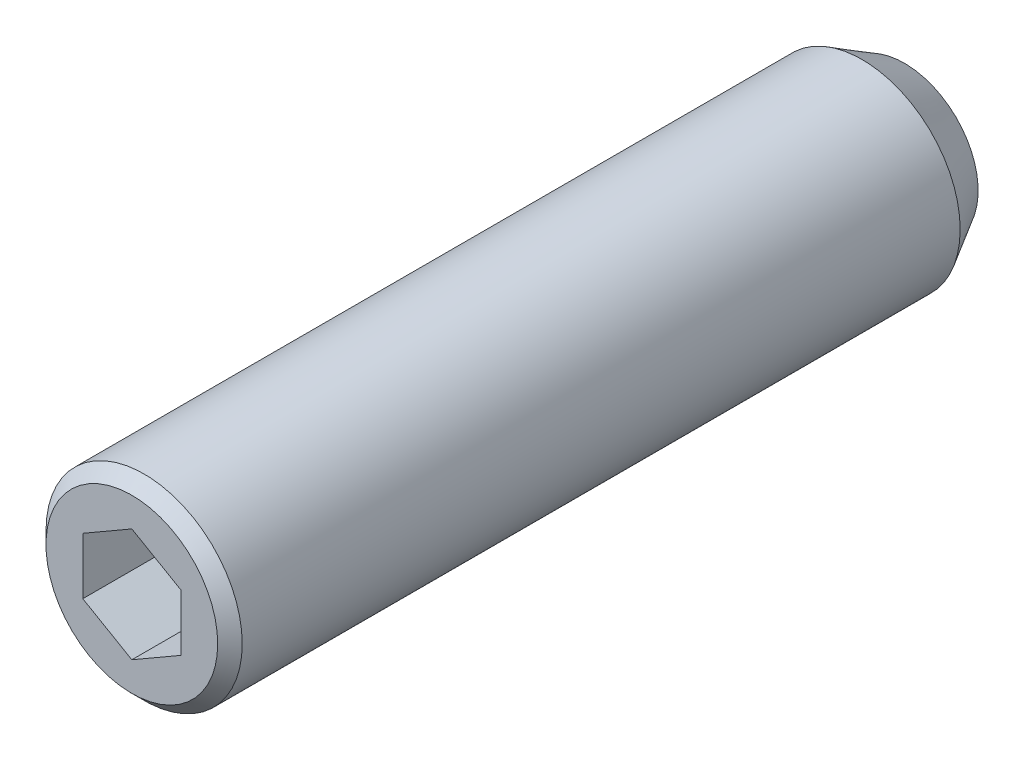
ISO-10303-21;
HEADER;
FILE_DESCRIPTION(('STEP AP214'),'2;1');
FILE_NAME('part.step','',(''),(''),'','','');
FILE_SCHEMA(('AUTOMOTIVE_DESIGN { 1 0 10303 214 1 1 1 1 }'));
ENDSEC;
DATA;
#1=APPLICATION_CONTEXT('core data for automotive mechanical design processes');
#2=APPLICATION_PROTOCOL_DEFINITION('international standard','automotive_design',2000,#1);
#3=PRODUCT_CONTEXT('',#1,'mechanical');
#4=PRODUCT('Part','Part','',(#3));
#5=PRODUCT_RELATED_PRODUCT_CATEGORY('part','',(#4));
#6=PRODUCT_DEFINITION_FORMATION('','',#4);
#7=PRODUCT_DEFINITION_CONTEXT('part definition',#1,'design');
#8=PRODUCT_DEFINITION('design','',#6,#7);
#9=PRODUCT_DEFINITION_SHAPE('','',#8);
#10=(LENGTH_UNIT() NAMED_UNIT(*) SI_UNIT(.MILLI.,.METRE.));
#11=(NAMED_UNIT(*) PLANE_ANGLE_UNIT() SI_UNIT($,.RADIAN.));
#12=(NAMED_UNIT(*) SI_UNIT($,.STERADIAN.) SOLID_ANGLE_UNIT());
#13=UNCERTAINTY_MEASURE_WITH_UNIT(LENGTH_MEASURE(1.E-05),#10,'distance_accuracy_value','');
#14=(GEOMETRIC_REPRESENTATION_CONTEXT(3) GLOBAL_UNCERTAINTY_ASSIGNED_CONTEXT((#13)) GLOBAL_UNIT_ASSIGNED_CONTEXT((#10,
#11,#12)) REPRESENTATION_CONTEXT('',''));
#15=CARTESIAN_POINT('',(0.,0.,0.));
#16=DIRECTION('',(0.,0.,1.));
#17=DIRECTION('',(1.,0.,0.));
#18=AXIS2_PLACEMENT_3D('',#15,#16,#17);
#19=CARTESIAN_POINT('',(1.,0.577350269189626,14.));
#20=DIRECTION('',(0.5,0.866025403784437,0.));
#21=DIRECTION('',(0.866025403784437,-0.5,0.));
#22=AXIS2_PLACEMENT_3D('',#19,#20,#21);
#23=PLANE('',#22);
#24=DIRECTION('',(0.,0.,1.));
#25=VECTOR('',#24,1.);
#26=CARTESIAN_POINT('',(1.,0.577350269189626,14.));
#27=LINE('',#26,#25);
#28=CARTESIAN_POINT('',(1.,0.577350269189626,14.));
#29=VERTEX_POINT('',#28);
#30=CARTESIAN_POINT('',(1.,0.577350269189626,16.));
#31=VERTEX_POINT('',#30);
#32=EDGE_CURVE('E96',#29,#31,#27,.T.);
#33=ORIENTED_EDGE('',*,*,#32,.T.);
#34=DIRECTION('',(-0.866025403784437,0.5,0.));
#35=VECTOR('',#34,1.);
#36=CARTESIAN_POINT('',(1.,0.577350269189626,16.));
#37=LINE('',#36,#35);
#38=CARTESIAN_POINT('',(0.,1.15470053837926,16.));
#39=VERTEX_POINT('',#38);
#40=EDGE_CURVE('E29',#31,#39,#37,.T.);
#41=ORIENTED_EDGE('',*,*,#40,.T.);
#42=DIRECTION('',(0.,0.,1.));
#43=VECTOR('',#42,1.);
#44=CARTESIAN_POINT('',(0.,1.15470053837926,14.));
#45=LINE('',#44,#43);
#46=CARTESIAN_POINT('',(0.,1.15470053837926,14.));
#47=VERTEX_POINT('',#46);
#48=EDGE_CURVE('E34',#47,#39,#45,.T.);
#49=ORIENTED_EDGE('',*,*,#48,.F.);
#50=DIRECTION('',(-0.866025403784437,0.5,0.));
#51=VECTOR('',#50,1.);
#52=CARTESIAN_POINT('',(1.,0.577350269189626,14.));
#53=LINE('',#52,#51);
#54=EDGE_CURVE('E90',#29,#47,#53,.T.);
#55=ORIENTED_EDGE('',*,*,#54,.F.);
#56=EDGE_LOOP('',(#33,#41,#49,#55));
#57=FACE_BOUND('',#56,.T.);
#58=ADVANCED_FACE('F14',(#57),#23,.F.);
#59=CARTESIAN_POINT('',(1.,-0.577350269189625,14.));
#60=DIRECTION('',(1.,0.,0.));
#61=DIRECTION('',(0.,-1.,0.));
#62=AXIS2_PLACEMENT_3D('',#59,#60,#61);
#63=PLANE('',#62);
#64=DIRECTION('',(0.,0.,1.));
#65=VECTOR('',#64,1.);
#66=CARTESIAN_POINT('',(1.,-0.577350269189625,14.));
#67=LINE('',#66,#65);
#68=CARTESIAN_POINT('',(1.,-0.577350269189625,14.));
#69=VERTEX_POINT('',#68);
#70=CARTESIAN_POINT('',(1.,-0.577350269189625,16.));
#71=VERTEX_POINT('',#70);
#72=EDGE_CURVE('E93',#69,#71,#67,.T.);
#73=ORIENTED_EDGE('',*,*,#72,.T.);
#74=DIRECTION('',(0.,1.,0.));
#75=VECTOR('',#74,1.);
#76=CARTESIAN_POINT('',(1.,-0.577350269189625,16.));
#77=LINE('',#76,#75);
#78=EDGE_CURVE('E120',#71,#31,#77,.T.);
#79=ORIENTED_EDGE('',*,*,#78,.T.);
#80=ORIENTED_EDGE('',*,*,#32,.F.);
#81=DIRECTION('',(0.,1.,0.));
#82=VECTOR('',#81,1.);
#83=CARTESIAN_POINT('',(1.,-0.577350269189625,14.));
#84=LINE('',#83,#82);
#85=EDGE_CURVE('E85',#69,#29,#84,.T.);
#86=ORIENTED_EDGE('',*,*,#85,.F.);
#87=EDGE_LOOP('',(#73,#79,#80,#86));
#88=FACE_BOUND('',#87,.T.);
#89=ADVANCED_FACE('F149',(#88),#63,.F.);
#90=CARTESIAN_POINT('',(1.,-0.577350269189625,14.));
#91=DIRECTION('',(-0.5,0.866025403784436,0.));
#92=DIRECTION('',(0.866025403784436,0.5,0.));
#93=AXIS2_PLACEMENT_3D('',#90,#91,#92);
#94=PLANE('',#93);
#95=DIRECTION('',(0.,0.,1.));
#96=VECTOR('',#95,1.);
#97=CARTESIAN_POINT('',(0.,-1.15470053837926,14.));
#98=LINE('',#97,#96);
#99=CARTESIAN_POINT('',(0.,-1.15470053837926,14.));
#100=VERTEX_POINT('',#99);
#101=CARTESIAN_POINT('',(0.,-1.15470053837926,16.));
#102=VERTEX_POINT('',#101);
#103=EDGE_CURVE('E68',#100,#102,#98,.T.);
#104=ORIENTED_EDGE('',*,*,#103,.T.);
#105=DIRECTION('',(-0.866025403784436,-0.5,0.));
#106=VECTOR('',#105,1.);
#107=CARTESIAN_POINT('',(1.,-0.577350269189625,16.));
#108=LINE('',#107,#106);
#109=EDGE_CURVE('E131',#71,#102,#108,.T.);
#110=ORIENTED_EDGE('',*,*,#109,.F.);
#111=ORIENTED_EDGE('',*,*,#72,.F.);
#112=DIRECTION('',(-0.866025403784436,-0.5,0.));
#113=VECTOR('',#112,1.);
#114=CARTESIAN_POINT('',(1.,-0.577350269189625,14.));
#115=LINE('',#114,#113);
#116=EDGE_CURVE('E83',#69,#100,#115,.T.);
#117=ORIENTED_EDGE('',*,*,#116,.T.);
#118=EDGE_LOOP('',(#104,#110,#111,#117));
#119=FACE_BOUND('',#118,.T.);
#120=ADVANCED_FACE('F155',(#119),#94,.T.);
#121=CARTESIAN_POINT('',(-1.,-0.577350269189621,14.));
#122=DIRECTION('',(-0.5,-0.866025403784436,0.));
#123=DIRECTION('',(-0.866025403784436,0.5,0.));
#124=AXIS2_PLACEMENT_3D('',#121,#122,#123);
#125=PLANE('',#124);
#126=DIRECTION('',(0.,0.,1.));
#127=VECTOR('',#126,1.);
#128=CARTESIAN_POINT('',(-1.,-0.577350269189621,14.));
#129=LINE('',#128,#127);
#130=CARTESIAN_POINT('',(-1.,-0.577350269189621,14.));
#131=VERTEX_POINT('',#130);
#132=CARTESIAN_POINT('',(-1.,-0.577350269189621,16.));
#133=VERTEX_POINT('',#132);
#134=EDGE_CURVE('E56',#131,#133,#129,.T.);
#135=ORIENTED_EDGE('',*,*,#134,.T.);
#136=DIRECTION('',(0.866025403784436,-0.5,0.));
#137=VECTOR('',#136,1.);
#138=CARTESIAN_POINT('',(-1.,-0.577350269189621,16.));
#139=LINE('',#138,#137);
#140=EDGE_CURVE('E128',#133,#102,#139,.T.);
#141=ORIENTED_EDGE('',*,*,#140,.T.);
#142=ORIENTED_EDGE('',*,*,#103,.F.);
#143=DIRECTION('',(0.866025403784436,-0.5,0.));
#144=VECTOR('',#143,1.);
#145=CARTESIAN_POINT('',(-1.,-0.577350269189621,14.));
#146=LINE('',#145,#144);
#147=EDGE_CURVE('E76',#131,#100,#146,.T.);
#148=ORIENTED_EDGE('',*,*,#147,.F.);
#149=EDGE_LOOP('',(#135,#141,#142,#148));
#150=FACE_BOUND('',#149,.T.);
#151=ADVANCED_FACE('F81',(#150),#125,.F.);
#152=CARTESIAN_POINT('',(-1.,-0.577350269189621,14.));
#153=DIRECTION('',(1.,0.,0.));
#154=DIRECTION('',(0.,-1.,0.));
#155=AXIS2_PLACEMENT_3D('',#152,#153,#154);
#156=PLANE('',#155);
#157=DIRECTION('',(0.,0.,1.));
#158=VECTOR('',#157,1.);
#159=CARTESIAN_POINT('',(-1.,0.577350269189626,14.));
#160=LINE('',#159,#158);
#161=CARTESIAN_POINT('',(-1.,0.577350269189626,14.));
#162=VERTEX_POINT('',#161);
#163=CARTESIAN_POINT('',(-1.,0.577350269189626,16.));
#164=VERTEX_POINT('',#163);
#165=EDGE_CURVE('E69',#162,#164,#160,.T.);
#166=ORIENTED_EDGE('',*,*,#165,.T.);
#167=DIRECTION('',(0.,1.,0.));
#168=VECTOR('',#167,1.);
#169=CARTESIAN_POINT('',(-1.,-0.577350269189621,16.));
#170=LINE('',#169,#168);
#171=EDGE_CURVE('E63',#133,#164,#170,.T.);
#172=ORIENTED_EDGE('',*,*,#171,.F.);
#173=ORIENTED_EDGE('',*,*,#134,.F.);
#174=DIRECTION('',(0.,1.,0.));
#175=VECTOR('',#174,1.);
#176=CARTESIAN_POINT('',(-1.,-0.577350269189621,14.));
#177=LINE('',#176,#175);
#178=EDGE_CURVE('E60',#131,#162,#177,.T.);
#179=ORIENTED_EDGE('',*,*,#178,.T.);
#180=EDGE_LOOP('',(#166,#172,#173,#179));
#181=FACE_BOUND('',#180,.T.);
#182=ADVANCED_FACE('F59',(#181),#156,.T.);
#183=CARTESIAN_POINT('',(-1.,0.577350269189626,14.));
#184=DIRECTION('',(0.5,-0.866025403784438,0.));
#185=DIRECTION('',(-0.866025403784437,-0.5,0.));
#186=AXIS2_PLACEMENT_3D('',#183,#184,#185);
#187=PLANE('',#186);
#188=DIRECTION('',(0.866025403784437,0.5,0.));
#189=VECTOR('',#188,1.);
#190=CARTESIAN_POINT('',(-1.,0.577350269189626,14.));
#191=LINE('',#190,#189);
#192=EDGE_CURVE('E79',#162,#47,#191,.T.);
#193=ORIENTED_EDGE('',*,*,#192,.T.);
#194=ORIENTED_EDGE('',*,*,#48,.T.);
#195=DIRECTION('',(0.866025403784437,0.5,0.));
#196=VECTOR('',#195,1.);
#197=CARTESIAN_POINT('',(-1.,0.577350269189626,16.));
#198=LINE('',#197,#196);
#199=EDGE_CURVE('E124',#164,#39,#198,.T.);
#200=ORIENTED_EDGE('',*,*,#199,.F.);
#201=ORIENTED_EDGE('',*,*,#165,.F.);
#202=EDGE_LOOP('',(#193,#194,#200,#201));
#203=FACE_BOUND('',#202,.T.);
#204=ADVANCED_FACE('F137',(#203),#187,.T.);
#205=CARTESIAN_POINT('',(2.,0.,14.));
#206=DIRECTION('',(0.,0.,1.));
#207=DIRECTION('',(-1.,0.,0.));
#208=AXIS2_PLACEMENT_3D('',#205,#206,#207);
#209=PLANE('',#208);
#210=ORIENTED_EDGE('',*,*,#54,.T.);
#211=ORIENTED_EDGE('',*,*,#192,.F.);
#212=ORIENTED_EDGE('',*,*,#178,.F.);
#213=ORIENTED_EDGE('',*,*,#147,.T.);
#214=ORIENTED_EDGE('',*,*,#116,.F.);
#215=ORIENTED_EDGE('',*,*,#85,.T.);
#216=EDGE_LOOP('',(#210,#211,#212,#213,#214,#215));
#217=FACE_BOUND('',#216,.T.);
#218=ADVANCED_FACE('F74',(#217),#209,.T.);
#219=CARTESIAN_POINT('',(0.,0.,15.75));
#220=DIRECTION('',(0.,0.,-1.));
#221=DIRECTION('',(1.,0.,0.));
#222=AXIS2_PLACEMENT_3D('',#219,#220,#221);
#223=CYLINDRICAL_SURFACE('',#222,2.);
#224=CARTESIAN_POINT('',(0.,0.,15.75));
#225=DIRECTION('',(0.,0.,-1.));
#226=DIRECTION('',(1.,0.,0.));
#227=AXIS2_PLACEMENT_3D('',#224,#225,#226);
#228=CIRCLE('',#227,2.);
#229=CARTESIAN_POINT('',(2.,0.,15.75));
#230=VERTEX_POINT('',#229);
#231=EDGE_CURVE('E101',#230,#230,#228,.T.);
#232=ORIENTED_EDGE('',*,*,#231,.T.);
#233=EDGE_LOOP('',(#232));
#234=FACE_BOUND('',#233,.T.);
#235=CARTESIAN_POINT('',(0.,0.,1.11602540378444));
#236=DIRECTION('',(0.,0.,-1.));
#237=DIRECTION('',(-1.,0.,0.));
#238=AXIS2_PLACEMENT_3D('',#235,#236,#237);
#239=CIRCLE('',#238,2.);
#240=CARTESIAN_POINT('',(-2.,0.,1.11602540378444));
#241=VERTEX_POINT('',#240);
#242=EDGE_CURVE('E117',#241,#241,#239,.T.);
#243=ORIENTED_EDGE('',*,*,#242,.F.);
#244=EDGE_LOOP('',(#243));
#245=FACE_BOUND('',#244,.T.);
#246=ADVANCED_FACE('F174',(#234,#245),#223,.T.);
#247=CARTESIAN_POINT('',(0.,0.,15.75));
#248=DIRECTION('',(0.,0.,-1.));
#249=DIRECTION('',(1.,0.,0.));
#250=AXIS2_PLACEMENT_3D('',#247,#248,#249);
#251=CONICAL_SURFACE('',#250,2.,0.785398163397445);
#252=CARTESIAN_POINT('',(0.,0.,16.));
#253=DIRECTION('',(0.,0.,-1.));
#254=DIRECTION('',(1.,0.,0.));
#255=AXIS2_PLACEMENT_3D('',#252,#253,#254);
#256=CIRCLE('',#255,1.75);
#257=CARTESIAN_POINT('',(1.75,0.,16.));
#258=VERTEX_POINT('',#257);
#259=EDGE_CURVE('E98',#258,#258,#256,.T.);
#260=ORIENTED_EDGE('',*,*,#259,.T.);
#261=EDGE_LOOP('',(#260));
#262=FACE_BOUND('',#261,.T.);
#263=ORIENTED_EDGE('',*,*,#231,.F.);
#264=EDGE_LOOP('',(#263));
#265=FACE_BOUND('',#264,.T.);
#266=ADVANCED_FACE('F182',(#262,#265),#251,.T.);
#267=CARTESIAN_POINT('',(0.,0.,16.));
#268=DIRECTION('',(0.,0.,-1.));
#269=DIRECTION('',(1.,0.,0.));
#270=AXIS2_PLACEMENT_3D('',#267,#268,#269);
#271=PLANE('',#270);
#272=ORIENTED_EDGE('',*,*,#199,.T.);
#273=ORIENTED_EDGE('',*,*,#40,.F.);
#274=ORIENTED_EDGE('',*,*,#78,.F.);
#275=ORIENTED_EDGE('',*,*,#109,.T.);
#276=ORIENTED_EDGE('',*,*,#140,.F.);
#277=ORIENTED_EDGE('',*,*,#171,.T.);
#278=EDGE_LOOP('',(#272,#273,#274,#275,#276,#277));
#279=FACE_BOUND('',#278,.T.);
#280=ORIENTED_EDGE('',*,*,#259,.F.);
#281=EDGE_LOOP('',(#280));
#282=FACE_BOUND('',#281,.T.);
#283=ADVANCED_FACE('F152',(#279,#282),#271,.F.);
#284=CARTESIAN_POINT('',(0.,0.,0.25));
#285=DIRECTION('',(0.,0.,1.));
#286=DIRECTION('',(1.,0.,0.));
#287=AXIS2_PLACEMENT_3D('',#284,#285,#286);
#288=CONICAL_SURFACE('',#287,1.5,0.523598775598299);
#289=ORIENTED_EDGE('',*,*,#242,.T.);
#290=EDGE_LOOP('',(#289));
#291=FACE_BOUND('',#290,.T.);
#292=CARTESIAN_POINT('',(0.,0.,0.25));
#293=DIRECTION('',(0.,0.,-1.));
#294=DIRECTION('',(-1.,0.,0.));
#295=AXIS2_PLACEMENT_3D('',#292,#293,#294);
#296=CIRCLE('',#295,1.5);
#297=CARTESIAN_POINT('',(-1.5,0.,0.25));
#298=VERTEX_POINT('',#297);
#299=EDGE_CURVE('E115',#298,#298,#296,.T.);
#300=ORIENTED_EDGE('',*,*,#299,.F.);
#301=EDGE_LOOP('',(#300));
#302=FACE_BOUND('',#301,.T.);
#303=ADVANCED_FACE('F196',(#291,#302),#288,.T.);
#304=CARTESIAN_POINT('',(0.,0.,0.));
#305=DIRECTION('',(0.,0.,-1.));
#306=DIRECTION('',(1.,0.,0.));
#307=AXIS2_PLACEMENT_3D('',#304,#305,#306);
#308=PLANE('',#307);
#309=CARTESIAN_POINT('',(0.,0.,0.));
#310=DIRECTION('',(0.,0.,-1.));
#311=DIRECTION('',(1.,0.,0.));
#312=AXIS2_PLACEMENT_3D('',#309,#310,#311);
#313=CIRCLE('',#312,1.);
#314=CARTESIAN_POINT('',(1.,0.,0.));
#315=VERTEX_POINT('',#314);
#316=EDGE_CURVE('E9',#315,#315,#313,.T.);
#317=ORIENTED_EDGE('',*,*,#316,.T.);
#318=EDGE_LOOP('',(#317));
#319=FACE_BOUND('',#318,.T.);
#320=ADVANCED_FACE('F16',(#319),#308,.T.);
#321=CARTESIAN_POINT('',(0.,0.,0.75));
#322=DIRECTION('',(0.,0.,-1.));
#323=DIRECTION('',(1.,0.,0.));
#324=AXIS2_PLACEMENT_3D('',#321,#322,#323);
#325=SPHERICAL_SURFACE('',#324,1.25);
#326=CARTESIAN_POINT('',(0.,0.,0.25));
#327=DIRECTION('',(0.,0.,-1.));
#328=DIRECTION('',(1.,0.,0.));
#329=AXIS2_PLACEMENT_3D('',#326,#327,#328);
#330=CIRCLE('',#329,1.14564392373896);
#331=CARTESIAN_POINT('',(1.14564392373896,0.,0.25));
#332=VERTEX_POINT('',#331);
#333=EDGE_CURVE('E22',#332,#332,#330,.T.);
#334=CARTESIAN_POINT('',(1.14564392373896,0.,0.25));
#335=CARTESIAN_POINT('',(1.14443567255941,0.,0.247231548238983));
#336=CARTESIAN_POINT('',(1.14321738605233,0.,0.244467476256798));
#337=CARTESIAN_POINT('',(1.14076080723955,0.,0.238948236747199));
#338=CARTESIAN_POINT('',(1.13952251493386,0.,0.236193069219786));
#339=CARTESIAN_POINT('',(1.13702598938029,0.,0.230691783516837));
#340=CARTESIAN_POINT('',(1.13576775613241,0.,0.227945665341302));
#341=CARTESIAN_POINT('',(1.13323141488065,0.,0.222462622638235));
#342=CARTESIAN_POINT('',(1.13195330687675,0.,0.219725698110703));
#343=CARTESIAN_POINT('',(1.12937728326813,0.,0.21426118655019));
#344=CARTESIAN_POINT('',(1.12807936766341,0.,0.21153359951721));
#345=CARTESIAN_POINT('',(1.12546379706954,0.,0.206087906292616));
#346=CARTESIAN_POINT('',(1.1241461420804,0.,0.203369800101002));
#347=CARTESIAN_POINT('',(1.12149116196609,0.,0.197943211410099));
#348=CARTESIAN_POINT('',(1.12015383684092,0.,0.195234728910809));
#349=CARTESIAN_POINT('',(1.11745958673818,0.,0.189827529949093));
#350=CARTESIAN_POINT('',(1.11610266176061,0.,0.187128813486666));
#351=CARTESIAN_POINT('',(1.11336928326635,0.,0.18174128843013));
#352=CARTESIAN_POINT('',(1.11199282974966,0.,0.179052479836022));
#353=CARTESIAN_POINT('',(1.10922046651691,0.,0.173684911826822));
#354=CARTESIAN_POINT('',(1.10782455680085,0.,0.171006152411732));
#355=CARTESIAN_POINT('',(1.10501335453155,0.,0.165658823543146));
#356=CARTESIAN_POINT('',(1.10359806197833,0.,0.16299025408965));
#357=CARTESIAN_POINT('',(1.10074816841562,0.,0.157663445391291));
#358=CARTESIAN_POINT('',(1.09931356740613,0.,0.155005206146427));
#359=CARTESIAN_POINT('',(1.09642513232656,0.,0.149699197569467));
#360=CARTESIAN_POINT('',(1.09497129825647,0.,0.14705142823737));
#361=CARTESIAN_POINT('',(1.09204447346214,0.,0.141766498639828));
#362=CARTESIAN_POINT('',(1.0905714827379,0.,0.139129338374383));
#363=CARTESIAN_POINT('',(1.08760642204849,0.,0.133865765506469));
#364=CARTESIAN_POINT('',(1.08611435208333,0.,0.131239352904));
#365=CARTESIAN_POINT('',(1.08311121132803,0.,0.125997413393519));
#366=CARTESIAN_POINT('',(1.0816001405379,0.,0.123381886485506));
#367=CARTESIAN_POINT('',(1.07855907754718,0.,0.118161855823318));
#368=CARTESIAN_POINT('',(1.0770290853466,0.,0.115557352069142));
#369=CARTESIAN_POINT('',(1.07395025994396,0.,0.110359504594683));
#370=CARTESIAN_POINT('',(1.07240142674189,0.,0.107766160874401));
#371=CARTESIAN_POINT('',(1.06928500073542,0.,0.102590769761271));
#372=CARTESIAN_POINT('',(1.06771740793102,0.,0.100008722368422));
#373=CARTESIAN_POINT('',(1.06456354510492,0.,0.0948560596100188));
#374=CARTESIAN_POINT('',(1.06297727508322,0.,0.0922854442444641));
#375=CARTESIAN_POINT('',(1.0597861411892,0.,0.0871557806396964));
#376=CARTESIAN_POINT('',(1.05818127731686,0.,0.0845967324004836));
#377=CARTESIAN_POINT('',(1.05495304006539,0.,0.0794903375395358));
#378=CARTESIAN_POINT('',(1.05332966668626,0.,0.0769429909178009));
#379=CARTESIAN_POINT('',(1.0500644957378,0.,0.071860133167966));
#380=CARTESIAN_POINT('',(1.04842269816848,0.,0.069324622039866));
#381=CARTESIAN_POINT('',(1.04512076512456,0.,0.0642655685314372));
#382=CARTESIAN_POINT('',(1.04346062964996,0.,0.0617420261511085));
#383=CARTESIAN_POINT('',(1.04012210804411,0.,0.0567070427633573));
#384=CARTESIAN_POINT('',(1.03844372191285,0.,0.0541956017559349));
#385=CARTESIAN_POINT('',(1.03506878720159,0.,0.0491849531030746));
#386=CARTESIAN_POINT('',(1.03337223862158,0.,0.0466857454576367));
#387=CARTESIAN_POINT('',(1.02996106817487,0.,0.0416996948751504));
#388=CARTESIAN_POINT('',(1.02824644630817,0.,0.039212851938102));
#389=CARTESIAN_POINT('',(1.02479921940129,0.,0.0342516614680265));
#390=CARTESIAN_POINT('',(1.02306661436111,0.,0.0317773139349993));
#391=CARTESIAN_POINT('',(1.01958351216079,0.,0.0268412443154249));
#392=CARTESIAN_POINT('',(1.01783301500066,0.,0.0243795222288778));
#393=CARTESIAN_POINT('',(1.01431422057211,0.,0.019468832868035));
#394=CARTESIAN_POINT('',(1.01254592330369,0.,0.0170198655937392));
#395=CARTESIAN_POINT('',(1.00899162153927,0.,0.012134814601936));
#396=CARTESIAN_POINT('',(1.00720561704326,0.,0.00969873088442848));
#397=CARTESIAN_POINT('',(1.00361599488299,0.,0.00483957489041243));
#398=CARTESIAN_POINT('',(1.00181237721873,0.,0.00241650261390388));
#399=CARTESIAN_POINT('',(1.,0.,0.));
#400=B_SPLINE_CURVE_WITH_KNOTS('',3,(#334,#335,#336,#337,#338,#339,#340,#341,#342,#343,#344,
#345,#346,#347,#348,#349,#350,#351,#352,#353,#354,#355,#356,#357,#358,#359,#360,#361,#362,#363,
#364,#365,#366,#367,#368,#369,#370,#371,#372,#373,#374,#375,#376,#377,#378,#379,#380,#381,#382,
#383,#384,#385,#386,#387,#388,#389,#390,#391,#392,#393,#394,#395,#396,#397,#398,#399),
.UNSPECIFIED.,.F.,.F.,(4,2,2,2,2,2,2,2,2,2,2,2,2,2,2,2,2,2,2,2,2,2,2,2,2,2,2,2,2,2,2,2,4),(0.,
0.00906186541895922,0.0181237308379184,0.0271855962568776,0.0362474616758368,0.045309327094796,
0.0543711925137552,0.0634330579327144,0.0724949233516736,0.0815567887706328,0.0906186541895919,
0.0996805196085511,0.10874238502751,0.11780425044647,0.126866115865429,0.135927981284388,
0.144989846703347,0.154051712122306,0.163113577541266,0.172175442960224,0.181237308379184,
0.190299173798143,0.199361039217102,0.208422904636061,0.21748477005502,0.22654663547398,
0.235608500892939,0.244670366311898,0.253732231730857,0.262794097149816,0.271855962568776,
0.280917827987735,0.289979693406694),.UNSPECIFIED.);
#401=EDGE_CURVE('BSEAM106',#332,#315,#400,.T.);
#402=ORIENTED_EDGE('',*,*,#333,.T.);
#403=ORIENTED_EDGE('',*,*,#316,.F.);
#404=ORIENTED_EDGE('',*,*,#401,.T.);
#405=ORIENTED_EDGE('',*,*,#401,.F.);
#406=EDGE_LOOP('',(#402,#404,#403,#405));
#407=FACE_BOUND('',#406,.T.);
#408=ADVANCED_FACE('F106',(#407),#325,.T.);
#409=CARTESIAN_POINT('',(1.42264973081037,0.,0.25));
#410=DIRECTION('',(0.,0.,1.));
#411=DIRECTION('',(-1.,0.,0.));
#412=AXIS2_PLACEMENT_3D('',#409,#410,#411);
#413=PLANE('',#412);
#414=ORIENTED_EDGE('',*,*,#333,.F.);
#415=EDGE_LOOP('',(#414));
#416=FACE_BOUND('',#415,.T.);
#417=ORIENTED_EDGE('',*,*,#299,.T.);
#418=EDGE_LOOP('',(#417));
#419=FACE_BOUND('',#418,.T.);
#420=ADVANCED_FACE('F109',(#416,#419),#413,.F.);
#421=CLOSED_SHELL('',(#58,#89,#120,#151,#182,#204,#218,#246,#266,#283,#303,#320,#408,#420));
#422=MANIFOLD_SOLID_BREP('B1',#421);
#423=ADVANCED_BREP_SHAPE_REPRESENTATION('',(#18,#422),#14);
#424=SHAPE_DEFINITION_REPRESENTATION(#9,#423);
ENDSEC;
END-ISO-10303-21;
